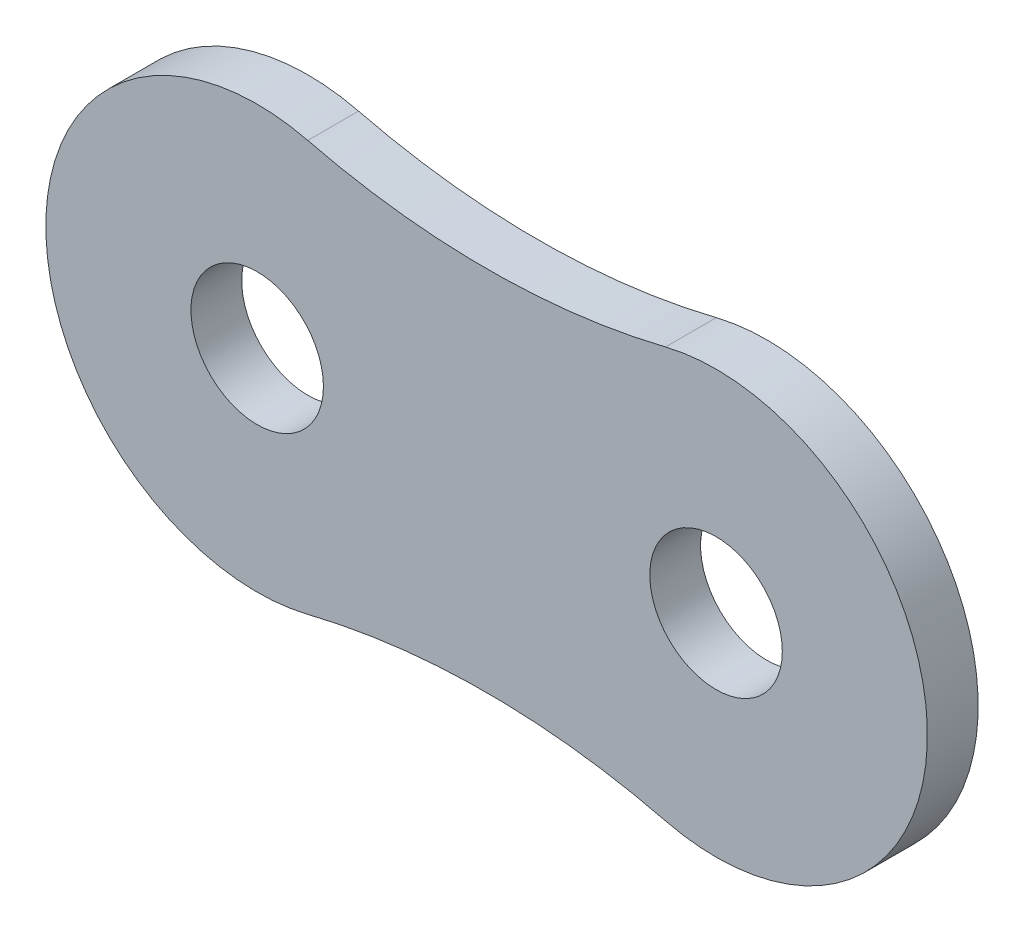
from build123d import *

# Parameters (mm, degrees)
EXTRUDE_1_DEPTH     = 0.885
SKETCH_3_R          = 1.155
CUT_EXTRUDE_1_DEPTH = 9.568644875


with BuildPart() as part:
    # Sketch 2 → Extrude 1 (new body)
    with BuildSketch(Plane.XY):
        with BuildLine():
            ThreePointArc((-3.118453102, 3.578002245), (-7.685, 0), (-3.118453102, -3.578002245))
            ThreePointArc((-3.118453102, -3.578002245), (0, -3.1995), (3.118453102, -3.578002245))
            ThreePointArc((3.118453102, -3.578002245), (7.685, 0), (3.118453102, 3.578002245))
            ThreePointArc((3.118453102, 3.578002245), (0, 3.1995), (-3.118453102, 3.578002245))
        make_face()
    extrude(amount=EXTRUDE_1_DEPTH)

    # Sketch 3 → Cut-Extrude 1 (cut, through all)
    with BuildSketch(Plane.XY.offset(0.885)):
        with Locations((-4, 0)):
            Circle(SKETCH_3_R)
        with Locations((4, 0)):
            Circle(SKETCH_3_R)
    extrude(amount=-CUT_EXTRUDE_1_DEPTH, mode=Mode.SUBTRACT)


solid = part.part
